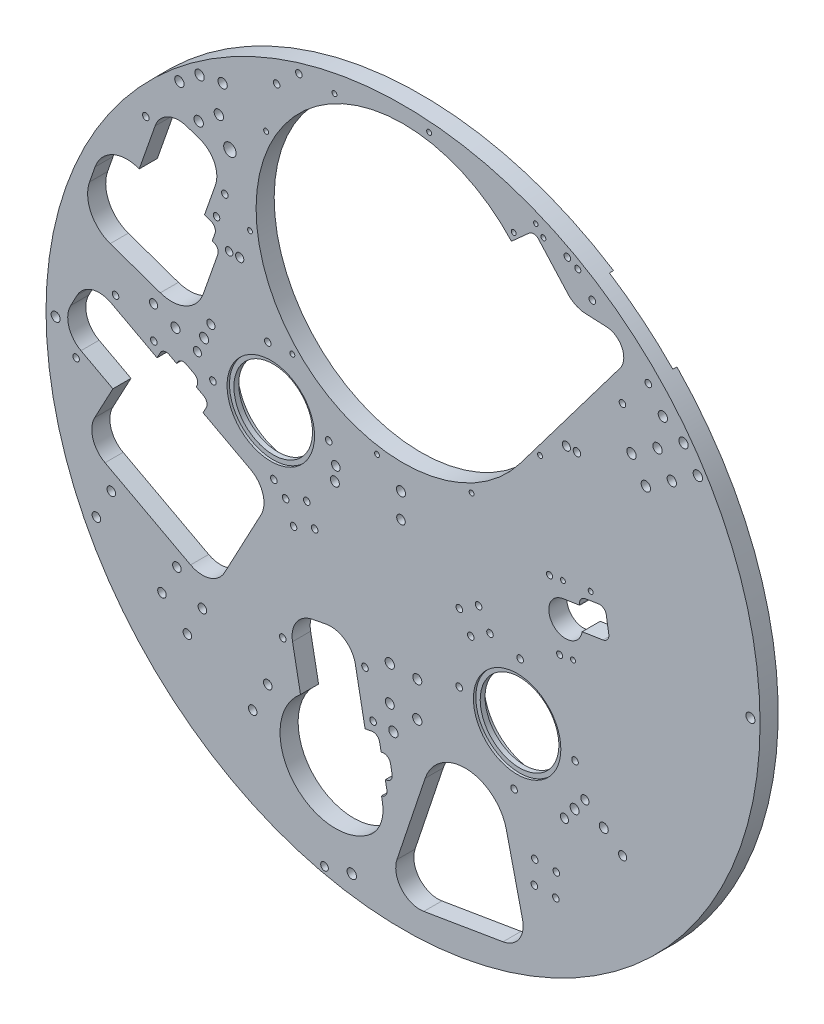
from build123d import *

# Parameters (mm, degrees)
SKETCH1_R                                      = 187.96
F_375_BASE_DEPTH                               = 9.525
CAROSEL_DEPTH                                  = 266.986181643
SKETCH5_R                                      = 20.701
HEATER_DEPTH                                   = 266.986181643
SKETCH8_R                                      = 27.0002
SKETCH8_R_2                                    = 27.00020001
HEATER_SEAL_DEPTH                              = 5.715
F_8_32_FOR_HEATERS_D                           = 3.4544
SKETCH9_R                                      = 23.0251
SAMPLE_HEATER_BORE_DEPTH                       = 1.27
F_3_16_FOR_CLAMPS_D                            = 4.7498
F_18_FOR_CLAMPS_D                              = 4.3053
SKETCH20_R                                     = 2.3749
LOCATING_PINS_FABRICATION_DEPTH                = 266.986181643
CAROUSEL_HALL_SENSOR_DEPTH                     = 266.986181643
FILLET3_R                                      = 3.556
F_5_40_TAPPED_HOLE1_D                          = 2.5781
F_3_32_0_093750_DIAMETER_HOLE1_D               = 2.38252
F_5_40_TAPPED_HOLE2_D                          = 2.5781
FILLET6_R                                      = 13.208
SKETCH41_R                                     = 27.978099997
CAROUSEL_DRIVE_DEPTH                           = 2.159
F_8_32_TAPPED_HOLE2_D                          = 3.4544
F_1_8_0_125000_DIAMETER_HOLE1_D                = 3.16738
F_8_32_TAPPED_HOLE3_D                          = 3.4544
INTERNAL_SAMPLER_DEPTH                         = 266.986181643
F_8_32_TAPPED_HOLE_SYRINGES_D                  = 3.4544
F_5_C_BORE_VALVE_MOUNTING_D                    = 3.4544
F_5_C_BORE_VALVE_MOUNTING_CBORE_D              = 6.35
F_5_C_BORE_VALVE_MOUNTING_CBORE_DEPTH          = 5.08
F_3_16_0_187500_DIAMETER_HOLE2_D               = 4.7498
F_10_0_193500_DIAMETER_HOLE2_D                 = 4.9149
CBORE_FOR_8_SOCKET_HEAD_CAP_SCREW1_D           = 4.5212
CBORE_FOR_8_SOCKET_HEAD_CAP_SCREW1_CBORE_D     = 7.366
CBORE_FOR_8_SOCKET_HEAD_CAP_SCREW1_CBORE_DEPTH = 5.08
F_3_16_0_187500_DIAMETER_HOLE3_D               = 4.7498
F_8_32_TAPPED_HOLE5_D                          = 3.4544
F_18_0_169500_DIAMETER_HOLE4_D                 = 4.3053
F_5_32_0_156250_DIAMETER_HOLE1_D               = 3.9624
F_10_0_1935_DIAMETER_HOLE1_D                   = 4.9149
CBORE_FOR_8_SOCKET_HEAD_CAP_SCREW2_D           = 4.4958
CBORE_FOR_8_SOCKET_HEAD_CAP_SCREW2_CBORE_D     = 7.9375
CBORE_FOR_8_SOCKET_HEAD_CAP_SCREW2_CBORE_DEPTH = 5.842
F_10_0_1935_DIAMETER_HOLE2_D                   = 4.9149
FLUSH_PUCK_HOLDER_DEPTH                        = 266.986181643
F_5_40_TAPPED_HOLE3_D                          = 2.5781
F_1_8_0_125_DIAMETER_HOLE1_D                   = 3.16738
PROCESSING_SYRINGE_DEPTH                       = 266.986181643
PRECIOUS_REAGENT_VALVE_DEPTH                   = 266.986181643
COLLECTION_SYRINGE_DEPTH                       = 266.986181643
F_10_0_1935_DIAMETER_HOLE3_D                   = 4.9149
F_0_257_DIAMETER_HOLE2_D                       = 6.5278
SKETCH94_R                                     = 2.4638
CUT_EXTRUDE8_DEPTH                             = 266.986181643
F_10_32_TAPPED_HOLE1_D                         = 4.0386


with BuildPart() as part:
    # Sketch1 → 375 base (new body)
    with BuildSketch(Plane.XY):
        with Locations(Location((0, 0, 0), (0, 0, 180))):
            Circle(SKETCH1_R)
    extrude(amount=F_375_BASE_DEPTH)

    # Sketch2 → carosel (cut, through all)
    with BuildSketch(Plane(origin=(0, 0, 0), x_dir=(-1, 0, 0), z_dir=(0, 0, -1))):
        with BuildLine():
            Line((-114.284247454, 125.157718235), (-61.772918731, 55.524336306))
            ThreePointArc((-61.772918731, 55.524336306), (77.281516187, 98.433971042), (-57.075052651, 154.34179727))
            Line((-57.075052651, 154.34179727), (-68.265403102, 142.114276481))
            Line((-68.265403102, 142.114276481), (-107.107515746, 140.393971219))
            ThreePointArc((-107.107515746, 140.393971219), (-115.295256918, 134.942288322), (-114.284247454, 125.157718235))
        make_face()
    extrude(amount=-CAROSEL_DEPTH, mode=Mode.SUBTRACT)

    # Sketch5 → heater (cut, through all)
    with BuildSketch(Plane(origin=(0, 0, 0), x_dir=(-1, 0, 0), z_dir=(0, 0, -1))):
        with Locations((69.616804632, 13.723398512)):
            Circle(SKETCH5_R)
        with Locations((-60.046419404, -64.185404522)):
            Circle(SKETCH5_R)
    extrude(amount=-HEATER_DEPTH, mode=Mode.SUBTRACT)

    # Sketch8 → heater seal (cut)
    with BuildSketch(Plane(origin=(0, 0, 0), x_dir=(-1, 0, 0), z_dir=(0, 0, -1))):
        with Locations((69.616804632, 13.723398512)):
            Circle(SKETCH8_R)
        with Locations((-60.046419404, -64.185404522)):
            Circle(SKETCH8_R_2)
    extrude(amount=-HEATER_SEAL_DEPTH, mode=Mode.SUBTRACT)

    # 8-32 for heaters (through all)
    with Locations(Plane.XY.offset(9.525)):
        with Locations((-100.10783128, 12.125431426), (-68.0188378, -16.767628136), (-71.214771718, 44.214424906), (-39.125778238, 15.321365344), (29.555392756, -62.587437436), (58.448452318, -94.676430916), (90.537446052, -65.783371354), (61.644386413, -33.694377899)):
            Hole(F_8_32_FOR_HEATERS_D / 2)

    # Sketch9 → Sample heater bore (cut)
    with BuildSketch(Plane.XY.offset(9.525)):
        with Locations((-69.616804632, 13.723398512)):
            Circle(SKETCH9_R)
        with Locations((60.046419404, -64.185404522)):
            Circle(SKETCH9_R)
    extrude(amount=-SAMPLE_HEATER_BORE_DEPTH, mode=Mode.SUBTRACT)

    # 3_16 for clamps (through all)
    with Locations(Plane.XY.offset(9.525)):
        with Locations((-104.724539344, 29.354369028), (-119.810856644, 26.506736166), (90.333833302, -87.848525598), (105.660927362, -88.735190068)):
            Hole(F_3_16_FOR_CLAMPS_D / 2)

    # 18 for clamps (through all)
    with Locations(Plane.XY.offset(9.525)):
        with Locations((-101.17063713, 37.336563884), (-131.34327173, 31.64129816), (-108.278441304, 21.372174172), (84.954429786, -94.733848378), (95.713237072, -80.963202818), (115.608617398, -96.507177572)):
            Hole(F_18_FOR_CLAMPS_D / 2)

    # Sketch20 → locating pins - fabrication (cut, through all)
    with BuildSketch(Plane(origin=(0, 0, 0), x_dir=(-1, 0, 0), z_dir=(0, 0, -1))):
        with Locations((182.88, 0)):
            Circle(SKETCH20_R)
        with Locations((-182.88, 0)):
            Circle(SKETCH20_R)
    extrude(amount=-LOCATING_PINS_FABRICATION_DEPTH, mode=Mode.SUBTRACT)

    # Sketch29 → carousel hall sensor (cut, through all)
    with BuildSketch(Plane(origin=(0, 0, 0), x_dir=(-1, 0, 0), z_dir=(0, 0, -1))):
        Polygon((-75.650603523, 127.743626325), (-54.101819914, 151.675975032), (-68.967549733, 165.061138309), (-90.516333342, 141.128789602), align=None)
    extrude(amount=-CAROUSEL_HALL_SENSOR_DEPTH, mode=Mode.SUBTRACT)

    # Fillet3
    fillet3_edges = [part.edges().sort_by_distance(p)[0] for p in [
        (68.967549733, 165.061138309, 4.7625),
    ]]
    fillet(fillet3_edges, radius=FILLET3_R)

    # 5-40 Tapped Hole1 (through all)
    with Locations(Plane(origin=(0, 0, 0), x_dir=(-1, 0, 0), z_dir=(0, 0, -1))):
        with Locations((-73.876422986, 164.354246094)):
            Hole(F_5_40_TAPPED_HOLE1_D / 2)

    # 3_32 _0.093750_ Diameter Hole1 (through all)
    with Locations(Plane(origin=(0, 0, 0), x_dir=(-1, 0, 0), z_dir=(0, 0, -1))):
        with Locations((-69.88238246, 168.79007771)):
            Hole(F_3_32_0_093750_DIAMETER_HOLE1_D / 2)

    # 5-40 Tapped Hole2 (through all)
    with Locations(Plane.XY.offset(9.525)):
        with Locations((36.078844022, 29.108006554), (58.27814354, 158.979258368), (13.71992176, 182.372847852), (-36.078844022, 175.107993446), (-13.71992176, 21.843152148), (-72.09671763, 139.959623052), (-80.576095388, 90.353218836), (-58.27814354, 45.236741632), (72.09671763, 64.256376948)):
            Hole(F_5_40_TAPPED_HOLE2_D / 2)

    # Fillet6
    fillet6_edges = [part.edges().sort_by_distance(p)[0] for p in [
        (90.516333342, 141.128789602, 4.7625),
    ]]
    fillet(fillet6_edges, radius=FILLET6_R)

    # Sketch41 → carousel drive (cut)
    with BuildSketch(Plane(origin=(0, 0, 0), x_dir=(-1, 0, 0), z_dir=(0, 0, -1))):
        with Locations((-106.686467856, 130.887290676)):
            Circle(SKETCH41_R)
    extrude(amount=-CAROUSEL_DRIVE_DEPTH, mode=Mode.SUBTRACT)

    # 8-32 Tapped Hole2 (through all)
    with Locations(Plane(origin=(0, 0, 2.159), x_dir=(-1, 0, 0), z_dir=(0, 0, -1))):
        with Locations((-99.646062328, 148.760401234), (-129.085362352, 125.509791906), (-115.50171972, 109.605389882)):
            Hole(F_8_32_TAPPED_HOLE2_D / 2)

    # 1_8 _0.125000_ Diameter Hole1 (through all)
    with Locations(Plane(origin=(0, 0, 0), x_dir=(-1, 0, 0), z_dir=(0, 0, -1))):
        with Locations((-91.9923738, 159.1778503)):
            Hole(F_1_8_0_125000_DIAMETER_HOLE1_D / 2)

    # 8-32 Tapped Hole3 (through all)
    with Locations(Plane(origin=(0, 0, 0), x_dir=(-1, 0, 0), z_dir=(0, 0, -1))):
        with Locations((-86.4987221, 161.835227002)):
            Hole(F_8_32_TAPPED_HOLE3_D / 2)

    # Sketch50 → Internal Sampler (cut, through all)
    with BuildSketch(Plane(origin=(0, 0, 0), x_dir=(-1, 0, 0), z_dir=(0, 0, -1))):
        with BuildLine():
            Line((106.870826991, 118.851784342), (113.702461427, 121.245921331))
            ThreePointArc((113.702461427, 121.245921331), (123.795791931, 120.683903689), (130.535447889, 113.14943476))
            Line((130.535447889, 113.14943476), (138.871807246, 89.361756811))
            Line((138.871807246, 89.361756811), (139.471073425, 89.571768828))
            ThreePointArc((139.471073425, 89.571768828), (153.058249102, 88.815206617), (162.130862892, 78.67265229))
            Line((162.130862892, 78.67265229), (165.051147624, 70.339663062))
            ThreePointArc((165.051147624, 70.339663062), (164.294585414, 56.752487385), (154.152031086, 47.679873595))
            Line((154.152031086, 47.679873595), (127.784319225, 38.439344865))
            ThreePointArc((127.784319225, 38.439344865), (114.197143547, 39.195907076), (105.124529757, 49.338461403))
            Line((105.124529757, 49.338461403), (97.522094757, 71.031897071))
            ThreePointArc((97.522094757, 71.031897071), (97.673407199, 73.749332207), (99.701918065, 75.563854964))
            Line((99.701918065, 75.563854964), (100.421037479, 75.815869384))
            Line((100.421037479, 75.815869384), (98.992955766, 79.890879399))
            ThreePointArc((98.992955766, 79.890879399), (99.144268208, 82.608314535), (101.172779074, 84.422837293))
            Line((101.172779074, 84.422837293), (104.528669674, 85.598904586))
            Line((104.528669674, 85.598904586), (98.77434042, 102.018797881))
            ThreePointArc((98.77434042, 102.018797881), (99.336358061, 112.112128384), (106.870826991, 118.851784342))
        make_face()
    extrude(amount=-INTERNAL_SAMPLER_DEPTH, mode=Mode.SUBTRACT)

    # 8-32 Tapped Hole _Syringes (through all)
    with Locations(Plane(origin=(0, 0, 0), x_dir=(-1, 0, 0), z_dir=(0, 0, -1))):
        with Locations((151.354249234, 25.515977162), (131.188829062, 14.748645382), (63.320319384, -86.662269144), (93.818355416, 100.416552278), (135.407428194, 114.991386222), (15.746835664, -100.854520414), (20.032792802, -78.399895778), (172.111271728, -13.358471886), (98.186605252, 87.951815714)):
            Hole(F_8_32_TAPPED_HOLE_SYRINGES_D / 2)

    # 5 C_bore valve mounting (through all)
    with Locations(Plane(origin=(0, 0, 0), x_dir=(-1, 0, 0), z_dir=(0, 0, -1))):
        with Locations((61.794718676, -22.42056349), (50.687393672, -18.045271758), (57.635757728, -32.978700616), (46.528432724, -28.603408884), (-35.644602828, -36.398314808), (-29.631216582, -26.774884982), (-39.755214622, -20.448708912), (-45.768600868, -30.072138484), (-80.666712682, -121.416835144), (-69.320700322, -121.21878982), (-80.45836588, -133.353017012), (-69.11235352, -133.154971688)):
            CounterBoreHole(F_5_C_BORE_VALVE_MOUNTING_D / 2, F_5_C_BORE_VALVE_MOUNTING_CBORE_D / 2, F_5_C_BORE_VALVE_MOUNTING_CBORE_DEPTH)

    # 3_16 _0.187500_ Diameter Hole2 (through all)
    with Locations(Plane.XY.offset(9.525)):
        with Locations((-6.985, -88.392), (7.493, -70.104)):
            Hole(F_3_16_0_187500_DIAMETER_HOLE2_D / 2)

    # 10 _0.193500_ Diameter Hole2 (through all)
    with Locations(Plane.XY.offset(9.525)):
        with Locations((7.493, -88.392), (-6.985, -70.104)):
            Hole(F_10_0_193500_DIAMETER_HOLE2_D / 2)

    # CBORE for _8 Socket Head Cap Screw1 (through all)
    with Locations(Plane(origin=(0, 0, 0), x_dir=(-1, 0, 0), z_dir=(0, 0, -1))):
        with Locations((35.37331, 5.757399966), (1.08331, -1.634000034)):
            CounterBoreHole(CBORE_FOR_8_SOCKET_HEAD_CAP_SCREW1_D / 2, CBORE_FOR_8_SOCKET_HEAD_CAP_SCREW1_CBORE_D / 2, CBORE_FOR_8_SOCKET_HEAD_CAP_SCREW1_CBORE_DEPTH)

    # 3_16 _0.187500_ Diameter Hole3 (through all)
    with Locations(Plane(origin=(0, 0, 0), x_dir=(-1, 0, 0), z_dir=(0, 0, -1))):
        with Locations((1.08331, 11.319999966), (35.89401, -1.634000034)):
            Hole(F_3_16_0_187500_DIAMETER_HOLE3_D / 2)

    # 8-32 Tapped Hole5 (through all)
    with Locations(Plane(origin=(0, 0, 0), x_dir=(-1, 0, 0), z_dir=(0, 0, -1))):
        with Locations((66.569437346, 164.27334176), (54.86639268, 174.810810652)):
            Hole(F_8_32_TAPPED_HOLE5_D / 2)

    # 18 _0.169500_ Diameter Hole4 (through all)
    with Locations(Plane(origin=(0, 0, 0), x_dir=(-1, 0, 0), z_dir=(0, 0, -1))):
        with Locations((85.979, 75.438), (-85.979, 75.438)):
            Hole(F_18_0_169500_DIAMETER_HOLE4_D / 2)

    # 5_32 _0.156250_ Diameter Hole1 (through all)
    with Locations(Plane(origin=(0, 0, 0), x_dir=(-1, 0, 0), z_dir=(0, 0, -1))):
        with Locations((-91.567, 75.438), (91.567, 75.438)):
            Hole(F_5_32_0_156250_DIAMETER_HOLE1_D / 2)

    # 10 _0.1935_ Diameter Hole1 (through all)
    with Locations(Plane(origin=(0, 0, 0), x_dir=(-1, 0, 0), z_dir=(0, 0, -1))):
        with Locations((-136.771817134, 114.370833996), (94.994039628, 150.364317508)):
            Hole(F_10_0_1935_DIAMETER_HOLE1_D / 2)

    # CBORE for _8 Socket Head Cap Screw2 (through all)
    with Locations(Plane(origin=(0, 0, 0), x_dir=(-1, 0, 0), z_dir=(0, 0, -1))):
        with Locations((79.124739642, -127.488478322), (71.20515858, -111.85387205), (105.646610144, -94.407838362), (113.566191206, -110.042444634), (119.07189292, -82.2124848), (126.91980458, -97.883188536), (161.440775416, -80.595035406), (153.592863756, -64.924331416)):
            CounterBoreHole(CBORE_FOR_8_SOCKET_HEAD_CAP_SCREW2_D / 2, CBORE_FOR_8_SOCKET_HEAD_CAP_SCREW2_CBORE_D / 2, CBORE_FOR_8_SOCKET_HEAD_CAP_SCREW2_CBORE_DEPTH)

    # 10 _0.1935_ Diameter Hole2 (through all)
    with Locations(Plane(origin=(0, 0, 0), x_dir=(-1, 0, 0), z_dir=(0, 0, -1))):
        with Locations((5.06776101, -100.338926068)):
            Hole(F_10_0_1935_DIAMETER_HOLE2_D / 2)

    # Sketch77 → flush puck holder (cut, through all)
    with BuildSketch(Plane(origin=(0, 0, 0), x_dir=(-1, 0, 0), z_dir=(0, 0, -1))):
        with BuildLine():
            Line((-93.008655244, 6.395647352), (-92.949053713, 6.771956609))
            ThreePointArc((-92.949053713, 6.771956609), (-93.58440902, 9.418401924), (-95.904992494, 10.840457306))
            Line((-95.904992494, 10.840457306), (-102.929431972, 11.953019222))
            ThreePointArc((-102.929431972, 11.953019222), (-105.575877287, 11.317663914), (-106.997932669, 8.99708044))
            Line((-106.997932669, 8.99708044), (-108.299889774, 0.776846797))
            ThreePointArc((-108.299889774, 0.776846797), (-107.664534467, -1.869598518), (-105.343950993, -3.2916539))
            Line((-105.343950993, -3.2916539), (-94.274529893, -5.044877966))
            ThreePointArc((-94.274529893, -5.044877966), (-79.327316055, -9.984749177), (-84.16686909, 4.995246))
            Line((-84.16686909, 4.995246), (-93.008655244, 6.395647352))
        make_face()
    extrude(amount=-FLUSH_PUCK_HOLDER_DEPTH, mode=Mode.SUBTRACT)

    # 5-40 Tapped Hole3 (through all)
    with Locations(Plane(origin=(0, 0, 0), x_dir=(-1, 0, 0), z_dir=(0, 0, -1))):
        with Locations((-89.46420385, -20.332393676), (-84.139800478, 13.284566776), (-98.75166178, 15.598858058)):
            Hole(F_5_40_TAPPED_HOLE3_D / 2)

    # 1_8 _0.125_ Diameter Hole1 (through all)
    with Locations(Plane(origin=(0, 0, 0), x_dir=(-1, 0, 0), z_dir=(0, 0, -1))):
        with Locations((-82.439764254, -21.444955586), (-77.115360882, 12.172004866)):
            Hole(F_1_8_0_125_DIAMETER_HOLE1_D / 2)

    # Sketch87 → processing syringe (cut, through all)
    with BuildSketch(Plane(origin=(0, 0, 0), x_dir=(-1, 0, 0), z_dir=(0, 0, -1))):
        with BuildLine():
            Line((19.980497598, -106.446439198), (25.123646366, -79.50088957))
            ThreePointArc((25.123646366, -79.50088957), (30.674609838, -71.052340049), (40.573760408, -69.003437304))
            Line((40.573760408, -69.003437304), (47.68439156, -70.360657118))
            ThreePointArc((47.68439156, -70.360657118), (56.132941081, -75.911620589), (58.181843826, -85.81077116))
            Line((58.181843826, -85.81077116), (53.979974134, -107.82485114))
            ThreePointArc((53.979974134, -107.82485114), (58.661056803, -148.371234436), (18.23728063, -154.013933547))
            ThreePointArc((18.23728063, -154.013933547), (11.839005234, -145.681153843), (10.868189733, -135.220242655))
            Line((10.868189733, -135.220242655), (11.344407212, -132.725284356))
            ThreePointArc((11.344407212, -132.725284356), (9.069797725, -131.23079419), (8.518170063, -128.565638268))
            Line((8.518170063, -128.565638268), (9.327739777, -124.32420916))
            Line((9.327739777, -124.32420916), (8.579252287, -124.181343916))
            ThreePointArc((8.579252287, -124.181343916), (6.3046428, -122.68685375), (5.753015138, -120.021697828))
            Line((5.753015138, -120.021697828), (6.6102066, -115.53077289))
            ThreePointArc((6.6102066, -115.53077289), (8.104696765, -113.256163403), (10.769852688, -112.704535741))
            Line((10.769852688, -112.704535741), (11.518340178, -112.847400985))
            Line((11.518340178, -112.847400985), (12.327909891, -108.605971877))
            ThreePointArc((12.327909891, -108.605971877), (13.822400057, -106.33136239), (16.48755598, -105.779734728))
            Line((16.48755598, -105.779734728), (19.980497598, -106.446439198))
        make_face()
    extrude(amount=-PROCESSING_SYRINGE_DEPTH, mode=Mode.SUBTRACT)

    # Sketch88 → precious reagent valve (cut, through all)
    with BuildSketch(Plane(origin=(0, 0, 0), x_dir=(-1, 0, 0), z_dir=(0, 0, -1))):
        with BuildLine():
            Line((-11.644016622, -113.165187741), (3.204004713, -157.662869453))
            ThreePointArc((3.204004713, -157.662869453), (0.81123781, -169.93411481), (-10.937626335, -174.208806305))
            Line((-10.937626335, -174.208806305), (-52.614983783, -167.239522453))
            ThreePointArc((-52.614983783, -167.239522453), (-61.084223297, -161.762919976), (-62.891132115, -151.840406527))
            Line((-62.891132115, -151.840406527), (-54.375130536, -115.172124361))
            ThreePointArc((-54.375130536, -115.172124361), (-33.768988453, -97.999414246), (-11.644016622, -113.165187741))
        make_face()
    extrude(amount=-PRECIOUS_REAGENT_VALVE_DEPTH, mode=Mode.SUBTRACT)

    # Sketch40 → Collection syringe (cut, through all)
    with BuildSketch(Plane(origin=(0, 0, 0), x_dir=(-1, 0, 0), z_dir=(0, 0, -1))):
        with BuildLine():
            Line((153.6947777, 20.86292408), (129.496273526, 7.942126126))
            Line((129.496273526, 7.942126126), (127.821355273, 11.07896926))
            ThreePointArc((127.821355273, 11.07896926), (125.718249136, 12.806480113), (123.009593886, 12.54089414))
            Line((123.009593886, 12.54089414), (119.200570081, 10.507064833))
            Line((119.200570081, 10.507064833), (118.841659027, 11.179245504))
            ThreePointArc((118.841659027, 11.179245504), (116.73855289, 12.906756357), (114.02989764, 12.641170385))
            Line((114.02989764, 12.641170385), (109.996813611, 10.487704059))
            ThreePointArc((109.996813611, 10.487704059), (108.269302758, 8.384597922), (108.534888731, 5.675942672))
            Line((108.534888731, 5.675942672), (108.893799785, 5.003762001))
            Line((108.893799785, 5.003762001), (105.08477598, 2.969932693))
            ThreePointArc((105.08477598, 2.969932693), (103.357265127, 0.866826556), (103.622851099, -1.841828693))
            Line((103.622851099, -1.841828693), (105.297769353, -4.978671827))
            Line((105.297769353, -4.978671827), (80.203024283, -18.378017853))
            ThreePointArc((80.203024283, -18.378017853), (73.786555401, -26.189554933), (74.773017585, -36.250274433))
            Line((74.773017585, -36.250274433), (93.974758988, -72.211940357))
            ThreePointArc((93.974758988, -72.211940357), (101.786296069, -78.62840924), (111.847015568, -77.641947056))
            Line((111.847015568, -77.641947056), (156.883120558, -53.594906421))
            ThreePointArc((156.883120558, -53.594906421), (163.29958944, -45.78336934), (162.313127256, -35.722649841))
            Line((162.313127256, -35.722649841), (152.742165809, -17.797831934))
            Line((152.742165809, -17.797831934), (169.546682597, -8.825055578))
            ThreePointArc((169.546682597, -8.825055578), (175.963151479, -1.013518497), (174.976689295, 9.047201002))
            Line((174.976689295, 9.047201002), (171.56703428, 15.432917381))
            ThreePointArc((171.56703428, 15.432917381), (163.755497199, 21.849386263), (153.6947777, 20.86292408))
        make_face()
    extrude(amount=-COLLECTION_SYRINGE_DEPTH, mode=Mode.SUBTRACT)

    # 10 _0.1935_ Diameter Hole3 (through all)
    with Locations(Plane.XY.offset(9.525)):
        with Locations((155.167743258, 96.542911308), (147.639888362, 107.703415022), (141.480332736, 87.310636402), (133.952478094, 98.47114037), (127.792922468, 78.078361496), (120.265067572, 89.238865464), (-117.739893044, 139.767234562), (-107.57532206, 126.757177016), (-107.131692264, 148.055269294), (-96.96712128, 135.045211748)):
            Hole(F_10_0_1935_DIAMETER_HOLE3_D / 2)

    # F _0.257_ Diameter Hole2 (through all)
    with Locations(Plane.XY.offset(9.525)):
        with Locations((-91.168731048, 122.011590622)):
            Hole(F_0_257_DIAMETER_HOLE2_D / 2)

    # Sketch94 → Cut-Extrude8 (cut, through all)
    with BuildSketch(Plane.XY.offset(9.525)):
        with Locations((-27.000137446, -175.994941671)):
            Circle(SKETCH94_R)
    extrude(amount=-CUT_EXTRUDE8_DEPTH, mode=Mode.SUBTRACT)

    # 10-32 Tapped Hole1 (through all)
    with Locations(Plane(origin=(-41.3512, -179.832, 9.525), x_dir=(1, 0, 0), z_dir=(0, 0, 1))):
        with Locations((0, 0)):
            Hole(F_10_32_TAPPED_HOLE1_D / 2)


solid = part.part
